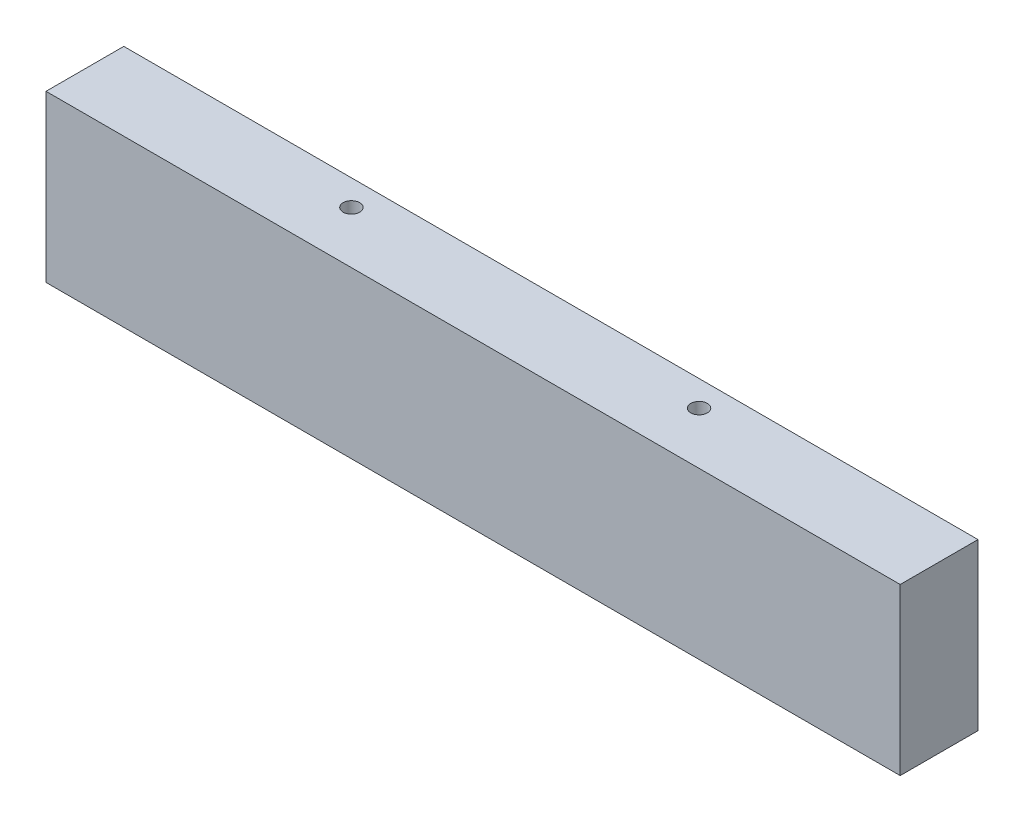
from build123d import *

# Parameters (mm, degrees)
SKETCH1_W           = 516
SKETCH1_H           = 47
BOSS_EXTRUDE1_DEPTH = 100
CUT_EXTRUDE1_REACH  = 529.698
SKETCH2_R           = 5


with BuildPart() as part:
    # Sketch1 → Boss-Extrude1 (new body)
    with BuildSketch(Plane(origin=(0, 0, 0), x_dir=(1, 0, 0), z_dir=(0, 1, 0))):
        with Locations((258, 23.5)):
            Rectangle(SKETCH1_W, SKETCH1_H)
    extrude(amount=BOSS_EXTRUDE1_DEPTH)

    # Sketch2 → Cut-Extrude1 (cut, up to next)
    with BuildSketch(Plane(origin=(0, 100, 0), x_dir=(1, 0, 0), z_dir=(0, 1, 0)), mode=Mode.PRIVATE) as cut_extrude1_sk1:
        with Locations(Location((153, 31.5, 0), (0, 0, 270))):
            Circle(SKETCH2_R)
    cut_extrude1_tool1 = extrude(cut_extrude1_sk1.sketch, amount=-CUT_EXTRUDE1_REACH, mode=Mode.PRIVATE) & part.part
    # Sketch2 → Cut-Extrude1 (cut, up to next)
    with BuildSketch(Plane(origin=(0, 100, 0), x_dir=(1, 0, 0), z_dir=(0, 1, 0)), mode=Mode.PRIVATE) as cut_extrude1_sk2:
        with Locations(Location((363, 31.5, 0), (0, 0, 270))):
            Circle(SKETCH2_R)
    cut_extrude1_tool2 = extrude(cut_extrude1_sk2.sketch, amount=-CUT_EXTRUDE1_REACH, mode=Mode.PRIVATE) & part.part
    add(cut_extrude1_tool1.solids().sort_by_distance((153, 100, -31.5))[0], mode=Mode.SUBTRACT)
    add(cut_extrude1_tool2.solids().sort_by_distance((363, 100, -31.5))[0], mode=Mode.SUBTRACT)


solid = part.part
